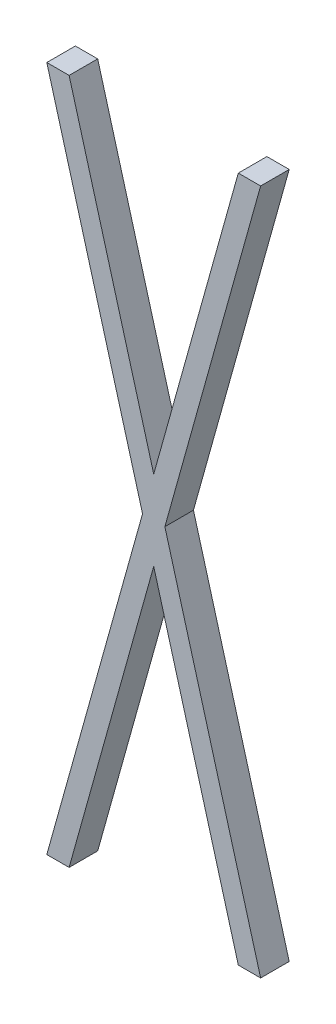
ISO-10303-21;
HEADER;
FILE_DESCRIPTION(('STEP AP214'),'2;1');
FILE_NAME('part.step','',(''),(''),'','','');
FILE_SCHEMA(('AUTOMOTIVE_DESIGN { 1 0 10303 214 1 1 1 1 }'));
ENDSEC;
DATA;
#1=APPLICATION_CONTEXT('core data for automotive mechanical design processes');
#2=APPLICATION_PROTOCOL_DEFINITION('international standard','automotive_design',2000,#1);
#3=PRODUCT_CONTEXT('',#1,'mechanical');
#4=PRODUCT('Part','Part','',(#3));
#5=PRODUCT_RELATED_PRODUCT_CATEGORY('part','',(#4));
#6=PRODUCT_DEFINITION_FORMATION('','',#4);
#7=PRODUCT_DEFINITION_CONTEXT('part definition',#1,'design');
#8=PRODUCT_DEFINITION('design','',#6,#7);
#9=PRODUCT_DEFINITION_SHAPE('','',#8);
#10=(LENGTH_UNIT() NAMED_UNIT(*) SI_UNIT(.MILLI.,.METRE.));
#11=(NAMED_UNIT(*) PLANE_ANGLE_UNIT() SI_UNIT($,.RADIAN.));
#12=(NAMED_UNIT(*) SI_UNIT($,.STERADIAN.) SOLID_ANGLE_UNIT());
#13=UNCERTAINTY_MEASURE_WITH_UNIT(LENGTH_MEASURE(1.E-05),#10,'distance_accuracy_value','');
#14=(GEOMETRIC_REPRESENTATION_CONTEXT(3) GLOBAL_UNCERTAINTY_ASSIGNED_CONTEXT((#13)) GLOBAL_UNIT_ASSIGNED_CONTEXT((#10,
#11,#12)) REPRESENTATION_CONTEXT('',''));
#15=CARTESIAN_POINT('',(0.,0.,0.));
#16=DIRECTION('',(0.,0.,1.));
#17=DIRECTION('',(1.,0.,0.));
#18=AXIS2_PLACEMENT_3D('',#15,#16,#17);
#19=CARTESIAN_POINT('',(12.1785029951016,30.0401103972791,3.175));
#20=DIRECTION('',(0.96316440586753,-0.268913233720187,0.));
#21=DIRECTION('',(0.268913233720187,0.96316440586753,0.));
#22=AXIS2_PLACEMENT_3D('',#19,#20,#21);
#23=PLANE('',#22);
#24=DIRECTION('',(-0.268913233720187,-0.96316440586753,0.));
#25=VECTOR('',#24,1.);
#26=CARTESIAN_POINT('',(12.1785029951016,30.0401103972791,0.));
#27=LINE('',#26,#25);
#28=CARTESIAN_POINT('',(12.1785029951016,30.0401103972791,0.));
#29=VERTEX_POINT('',#28);
#30=CARTESIAN_POINT('',(2.78050299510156,-3.62063199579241,0.));
#31=VERTEX_POINT('',#30);
#32=EDGE_CURVE('E150',#29,#31,#27,.T.);
#33=ORIENTED_EDGE('',*,*,#32,.T.);
#34=DIRECTION('',(0.,0.,-1.));
#35=VECTOR('',#34,1.);
#36=CARTESIAN_POINT('',(2.78050299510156,-3.62063199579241,3.175));
#37=LINE('',#36,#35);
#38=CARTESIAN_POINT('',(2.78050299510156,-3.62063199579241,3.175));
#39=VERTEX_POINT('',#38);
#40=EDGE_CURVE('E11',#39,#31,#37,.T.);
#41=ORIENTED_EDGE('',*,*,#40,.F.);
#42=DIRECTION('',(-0.268913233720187,-0.96316440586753,0.));
#43=VECTOR('',#42,1.);
#44=CARTESIAN_POINT('',(12.1785029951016,30.0401103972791,3.175));
#45=LINE('',#44,#43);
#46=CARTESIAN_POINT('',(12.1785029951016,30.0401103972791,3.175));
#47=VERTEX_POINT('',#46);
#48=EDGE_CURVE('E172',#47,#39,#45,.T.);
#49=ORIENTED_EDGE('',*,*,#48,.F.);
#50=DIRECTION('',(0.,0.,-1.));
#51=VECTOR('',#50,1.);
#52=CARTESIAN_POINT('',(12.1785029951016,30.0401103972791,3.175));
#53=LINE('',#52,#51);
#54=EDGE_CURVE('E146',#47,#29,#53,.T.);
#55=ORIENTED_EDGE('',*,*,#54,.T.);
#56=EDGE_LOOP('',(#33,#41,#49,#55));
#57=FACE_BOUND('',#56,.T.);
#58=ADVANCED_FACE('F30',(#57),#23,.F.);
#59=CARTESIAN_POINT('',(-6.61749700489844,30.0401103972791,3.175));
#60=DIRECTION('',(-0.96316440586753,-0.268913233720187,0.));
#61=DIRECTION('',(0.268913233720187,-0.96316440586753,0.));
#62=AXIS2_PLACEMENT_3D('',#59,#60,#61);
#63=PLANE('',#62);
#64=DIRECTION('',(-0.268913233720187,0.96316440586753,0.));
#65=VECTOR('',#64,1.);
#66=CARTESIAN_POINT('',(-6.61749700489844,30.0401103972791,0.));
#67=LINE('',#66,#65);
#68=CARTESIAN_POINT('',(-6.61749700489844,30.0401103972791,0.));
#69=VERTEX_POINT('',#68);
#70=EDGE_CURVE('E153',#31,#69,#67,.T.);
#71=ORIENTED_EDGE('',*,*,#70,.T.);
#72=DIRECTION('',(0.,0.,-1.));
#73=VECTOR('',#72,1.);
#74=CARTESIAN_POINT('',(-6.61749700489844,30.0401103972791,3.175));
#75=LINE('',#74,#73);
#76=CARTESIAN_POINT('',(-6.61749700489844,30.0401103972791,3.175));
#77=VERTEX_POINT('',#76);
#78=EDGE_CURVE('E38',#77,#69,#75,.T.);
#79=ORIENTED_EDGE('',*,*,#78,.F.);
#80=DIRECTION('',(-0.268913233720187,0.96316440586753,0.));
#81=VECTOR('',#80,1.);
#82=CARTESIAN_POINT('',(-6.61749700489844,30.0401103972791,3.175));
#83=LINE('',#82,#81);
#84=EDGE_CURVE('E101',#39,#77,#83,.T.);
#85=ORIENTED_EDGE('',*,*,#84,.F.);
#86=ORIENTED_EDGE('',*,*,#40,.T.);
#87=EDGE_LOOP('',(#71,#79,#85,#86));
#88=FACE_BOUND('',#87,.T.);
#89=ADVANCED_FACE('F250',(#88),#63,.F.);
#90=CARTESIAN_POINT('',(-9.09635754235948,30.0401103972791,3.175));
#91=DIRECTION('',(0.,-1.,0.));
#92=DIRECTION('',(0.,0.,-1.));
#93=AXIS2_PLACEMENT_3D('',#90,#91,#92);
#94=PLANE('',#93);
#95=DIRECTION('',(-1.,0.,0.));
#96=VECTOR('',#95,1.);
#97=CARTESIAN_POINT('',(-9.09635754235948,30.0401103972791,0.));
#98=LINE('',#97,#96);
#99=CARTESIAN_POINT('',(-9.09635754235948,30.0401103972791,0.));
#100=VERTEX_POINT('',#99);
#101=EDGE_CURVE('E155',#69,#100,#98,.T.);
#102=ORIENTED_EDGE('',*,*,#101,.T.);
#103=DIRECTION('',(0.,0.,-1.));
#104=VECTOR('',#103,1.);
#105=CARTESIAN_POINT('',(-9.09635754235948,30.0401103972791,3.175));
#106=LINE('',#105,#104);
#107=CARTESIAN_POINT('',(-9.09635754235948,30.0401103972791,3.175));
#108=VERTEX_POINT('',#107);
#109=EDGE_CURVE('E191',#108,#100,#106,.T.);
#110=ORIENTED_EDGE('',*,*,#109,.F.);
#111=DIRECTION('',(-1.,0.,0.));
#112=VECTOR('',#111,1.);
#113=CARTESIAN_POINT('',(-9.09635754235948,30.0401103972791,3.175));
#114=LINE('',#113,#112);
#115=EDGE_CURVE('E199',#77,#108,#114,.T.);
#116=ORIENTED_EDGE('',*,*,#115,.F.);
#117=ORIENTED_EDGE('',*,*,#78,.T.);
#118=EDGE_LOOP('',(#102,#110,#116,#117));
#119=FACE_BOUND('',#118,.T.);
#120=ADVANCED_FACE('F197',(#119),#94,.F.);
#121=CARTESIAN_POINT('',(1.54107272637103,-8.05988960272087,3.175));
#122=DIRECTION('',(0.96316440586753,0.268913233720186,0.));
#123=DIRECTION('',(-0.268913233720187,0.96316440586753,0.));
#124=AXIS2_PLACEMENT_3D('',#121,#122,#123);
#125=PLANE('',#124);
#126=DIRECTION('',(0.268913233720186,-0.96316440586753,0.));
#127=VECTOR('',#126,1.);
#128=CARTESIAN_POINT('',(1.54107272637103,-8.05988960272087,0.));
#129=LINE('',#128,#127);
#130=CARTESIAN_POINT('',(1.54107272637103,-8.05988960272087,0.));
#131=VERTEX_POINT('',#130);
#132=EDGE_CURVE('E157',#100,#131,#129,.T.);
#133=ORIENTED_EDGE('',*,*,#132,.T.);
#134=DIRECTION('',(0.,0.,-1.));
#135=VECTOR('',#134,1.);
#136=CARTESIAN_POINT('',(1.54107272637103,-8.05988960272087,3.175));
#137=LINE('',#136,#135);
#138=CARTESIAN_POINT('',(1.54107272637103,-8.05988960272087,3.175));
#139=VERTEX_POINT('',#138);
#140=EDGE_CURVE('E188',#139,#131,#137,.T.);
#141=ORIENTED_EDGE('',*,*,#140,.F.);
#142=DIRECTION('',(0.268913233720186,-0.96316440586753,0.));
#143=VECTOR('',#142,1.);
#144=CARTESIAN_POINT('',(1.54107272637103,-8.05988960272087,3.175));
#145=LINE('',#144,#143);
#146=EDGE_CURVE('E217',#108,#139,#145,.T.);
#147=ORIENTED_EDGE('',*,*,#146,.F.);
#148=ORIENTED_EDGE('',*,*,#109,.T.);
#149=EDGE_LOOP('',(#133,#141,#147,#148));
#150=FACE_BOUND('',#149,.T.);
#151=ADVANCED_FACE('F208',(#150),#125,.F.);
#152=CARTESIAN_POINT('',(1.54107272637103,-8.05988960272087,3.175));
#153=DIRECTION('',(0.96316440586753,-0.268913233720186,0.));
#154=DIRECTION('',(0.268913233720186,0.96316440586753,0.));
#155=AXIS2_PLACEMENT_3D('',#152,#153,#154);
#156=PLANE('',#155);
#157=DIRECTION('',(-0.268913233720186,-0.96316440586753,0.));
#158=VECTOR('',#157,1.);
#159=CARTESIAN_POINT('',(1.54107272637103,-8.05988960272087,0.));
#160=LINE('',#159,#158);
#161=CARTESIAN_POINT('',(-9.09635754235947,-46.1598896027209,0.));
#162=VERTEX_POINT('',#161);
#163=EDGE_CURVE('E159',#131,#162,#160,.T.);
#164=ORIENTED_EDGE('',*,*,#163,.T.);
#165=DIRECTION('',(0.,0.,-1.));
#166=VECTOR('',#165,1.);
#167=CARTESIAN_POINT('',(-9.09635754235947,-46.1598896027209,3.175));
#168=LINE('',#167,#166);
#169=CARTESIAN_POINT('',(-9.09635754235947,-46.1598896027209,3.175));
#170=VERTEX_POINT('',#169);
#171=EDGE_CURVE('E185',#170,#162,#168,.T.);
#172=ORIENTED_EDGE('',*,*,#171,.F.);
#173=DIRECTION('',(-0.268913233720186,-0.96316440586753,0.));
#174=VECTOR('',#173,1.);
#175=CARTESIAN_POINT('',(1.54107272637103,-8.05988960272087,3.175));
#176=LINE('',#175,#174);
#177=EDGE_CURVE('E214',#139,#170,#176,.T.);
#178=ORIENTED_EDGE('',*,*,#177,.F.);
#179=ORIENTED_EDGE('',*,*,#140,.T.);
#180=EDGE_LOOP('',(#164,#172,#178,#179));
#181=FACE_BOUND('',#180,.T.);
#182=ADVANCED_FACE('F212',(#181),#156,.F.);
#183=CARTESIAN_POINT('',(-9.09635754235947,-46.1598896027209,3.175));
#184=DIRECTION('',(0.,1.,0.));
#185=DIRECTION('',(0.,0.,1.));
#186=AXIS2_PLACEMENT_3D('',#183,#184,#185);
#187=PLANE('',#186);
#188=DIRECTION('',(1.,0.,0.));
#189=VECTOR('',#188,1.);
#190=CARTESIAN_POINT('',(-9.09635754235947,-46.1598896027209,0.));
#191=LINE('',#190,#189);
#192=CARTESIAN_POINT('',(-6.61749700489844,-46.1598896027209,0.));
#193=VERTEX_POINT('',#192);
#194=EDGE_CURVE('E161',#162,#193,#191,.T.);
#195=ORIENTED_EDGE('',*,*,#194,.T.);
#196=DIRECTION('',(0.,0.,-1.));
#197=VECTOR('',#196,1.);
#198=CARTESIAN_POINT('',(-6.61749700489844,-46.1598896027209,3.175));
#199=LINE('',#198,#197);
#200=CARTESIAN_POINT('',(-6.61749700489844,-46.1598896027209,3.175));
#201=VERTEX_POINT('',#200);
#202=EDGE_CURVE('E182',#201,#193,#199,.T.);
#203=ORIENTED_EDGE('',*,*,#202,.F.);
#204=DIRECTION('',(1.,0.,0.));
#205=VECTOR('',#204,1.);
#206=CARTESIAN_POINT('',(-9.09635754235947,-46.1598896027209,3.175));
#207=LINE('',#206,#205);
#208=EDGE_CURVE('E216',#170,#201,#207,.T.);
#209=ORIENTED_EDGE('',*,*,#208,.F.);
#210=ORIENTED_EDGE('',*,*,#171,.T.);
#211=EDGE_LOOP('',(#195,#203,#209,#210));
#212=FACE_BOUND('',#211,.T.);
#213=ADVANCED_FACE('F263',(#212),#187,.F.);
#214=CARTESIAN_POINT('',(-6.61749700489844,-46.1598896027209,3.175));
#215=DIRECTION('',(-0.96316440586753,0.268913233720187,0.));
#216=DIRECTION('',(-0.268913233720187,-0.96316440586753,0.));
#217=AXIS2_PLACEMENT_3D('',#214,#215,#216);
#218=PLANE('',#217);
#219=DIRECTION('',(0.268913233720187,0.96316440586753,0.));
#220=VECTOR('',#219,1.);
#221=CARTESIAN_POINT('',(-6.61749700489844,-46.1598896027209,0.));
#222=LINE('',#221,#220);
#223=CARTESIAN_POINT('',(2.78050299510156,-12.4991472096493,0.));
#224=VERTEX_POINT('',#223);
#225=EDGE_CURVE('E163',#193,#224,#222,.T.);
#226=ORIENTED_EDGE('',*,*,#225,.T.);
#227=DIRECTION('',(0.,0.,-1.));
#228=VECTOR('',#227,1.);
#229=CARTESIAN_POINT('',(2.78050299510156,-12.4991472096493,3.175));
#230=LINE('',#229,#228);
#231=CARTESIAN_POINT('',(2.78050299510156,-12.4991472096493,3.175));
#232=VERTEX_POINT('',#231);
#233=EDGE_CURVE('E179',#232,#224,#230,.T.);
#234=ORIENTED_EDGE('',*,*,#233,.F.);
#235=DIRECTION('',(0.268913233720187,0.96316440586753,0.));
#236=VECTOR('',#235,1.);
#237=CARTESIAN_POINT('',(-6.61749700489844,-46.1598896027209,3.175));
#238=LINE('',#237,#236);
#239=EDGE_CURVE('E219',#201,#232,#238,.T.);
#240=ORIENTED_EDGE('',*,*,#239,.F.);
#241=ORIENTED_EDGE('',*,*,#202,.T.);
#242=EDGE_LOOP('',(#226,#234,#240,#241));
#243=FACE_BOUND('',#242,.T.);
#244=ADVANCED_FACE('F266',(#243),#218,.F.);
#245=CARTESIAN_POINT('',(12.1785029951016,-46.1598896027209,3.175));
#246=DIRECTION('',(0.96316440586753,0.268913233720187,0.));
#247=DIRECTION('',(-0.268913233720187,0.96316440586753,0.));
#248=AXIS2_PLACEMENT_3D('',#245,#246,#247);
#249=PLANE('',#248);
#250=DIRECTION('',(0.268913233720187,-0.96316440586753,0.));
#251=VECTOR('',#250,1.);
#252=CARTESIAN_POINT('',(12.1785029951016,-46.1598896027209,0.));
#253=LINE('',#252,#251);
#254=CARTESIAN_POINT('',(12.1785029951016,-46.1598896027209,0.));
#255=VERTEX_POINT('',#254);
#256=EDGE_CURVE('E165',#224,#255,#253,.T.);
#257=ORIENTED_EDGE('',*,*,#256,.T.);
#258=DIRECTION('',(0.,0.,-1.));
#259=VECTOR('',#258,1.);
#260=CARTESIAN_POINT('',(12.1785029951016,-46.1598896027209,3.175));
#261=LINE('',#260,#259);
#262=CARTESIAN_POINT('',(12.1785029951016,-46.1598896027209,3.175));
#263=VERTEX_POINT('',#262);
#264=EDGE_CURVE('E176',#263,#255,#261,.T.);
#265=ORIENTED_EDGE('',*,*,#264,.F.);
#266=DIRECTION('',(0.268913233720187,-0.96316440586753,0.));
#267=VECTOR('',#266,1.);
#268=CARTESIAN_POINT('',(12.1785029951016,-46.1598896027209,3.175));
#269=LINE('',#268,#267);
#270=EDGE_CURVE('E225',#232,#263,#269,.T.);
#271=ORIENTED_EDGE('',*,*,#270,.F.);
#272=ORIENTED_EDGE('',*,*,#233,.T.);
#273=EDGE_LOOP('',(#257,#265,#271,#272));
#274=FACE_BOUND('',#273,.T.);
#275=ADVANCED_FACE('F231',(#274),#249,.F.);
#276=CARTESIAN_POINT('',(14.6573635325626,-46.1598896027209,3.175));
#277=DIRECTION('',(0.,1.,0.));
#278=DIRECTION('',(0.,0.,1.));
#279=AXIS2_PLACEMENT_3D('',#276,#277,#278);
#280=PLANE('',#279);
#281=DIRECTION('',(1.,0.,0.));
#282=VECTOR('',#281,1.);
#283=CARTESIAN_POINT('',(14.6573635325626,-46.1598896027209,0.));
#284=LINE('',#283,#282);
#285=CARTESIAN_POINT('',(14.6573635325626,-46.1598896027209,0.));
#286=VERTEX_POINT('',#285);
#287=EDGE_CURVE('E167',#255,#286,#284,.T.);
#288=ORIENTED_EDGE('',*,*,#287,.T.);
#289=DIRECTION('',(0.,0.,-1.));
#290=VECTOR('',#289,1.);
#291=CARTESIAN_POINT('',(14.6573635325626,-46.1598896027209,3.175));
#292=LINE('',#291,#290);
#293=CARTESIAN_POINT('',(14.6573635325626,-46.1598896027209,3.175));
#294=VERTEX_POINT('',#293);
#295=EDGE_CURVE('E141',#294,#286,#292,.T.);
#296=ORIENTED_EDGE('',*,*,#295,.F.);
#297=DIRECTION('',(1.,0.,0.));
#298=VECTOR('',#297,1.);
#299=CARTESIAN_POINT('',(14.6573635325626,-46.1598896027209,3.175));
#300=LINE('',#299,#298);
#301=EDGE_CURVE('E132',#263,#294,#300,.T.);
#302=ORIENTED_EDGE('',*,*,#301,.F.);
#303=ORIENTED_EDGE('',*,*,#264,.T.);
#304=EDGE_LOOP('',(#288,#296,#302,#303));
#305=FACE_BOUND('',#304,.T.);
#306=ADVANCED_FACE('F235',(#305),#280,.F.);
#307=CARTESIAN_POINT('',(4.01993326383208,-8.05988960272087,3.175));
#308=DIRECTION('',(-0.96316440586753,-0.268913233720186,0.));
#309=DIRECTION('',(0.268913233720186,-0.96316440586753,0.));
#310=AXIS2_PLACEMENT_3D('',#307,#308,#309);
#311=PLANE('',#310);
#312=DIRECTION('',(-0.268913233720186,0.96316440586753,0.));
#313=VECTOR('',#312,1.);
#314=CARTESIAN_POINT('',(4.01993326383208,-8.05988960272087,0.));
#315=LINE('',#314,#313);
#316=CARTESIAN_POINT('',(4.01993326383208,-8.05988960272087,0.));
#317=VERTEX_POINT('',#316);
#318=EDGE_CURVE('E140',#286,#317,#315,.T.);
#319=ORIENTED_EDGE('',*,*,#318,.T.);
#320=DIRECTION('',(0.,0.,-1.));
#321=VECTOR('',#320,1.);
#322=CARTESIAN_POINT('',(4.01993326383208,-8.05988960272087,3.175));
#323=LINE('',#322,#321);
#324=CARTESIAN_POINT('',(4.01993326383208,-8.05988960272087,3.175));
#325=VERTEX_POINT('',#324);
#326=EDGE_CURVE('E137',#325,#317,#323,.T.);
#327=ORIENTED_EDGE('',*,*,#326,.F.);
#328=DIRECTION('',(-0.268913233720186,0.96316440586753,0.));
#329=VECTOR('',#328,1.);
#330=CARTESIAN_POINT('',(4.01993326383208,-8.05988960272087,3.175));
#331=LINE('',#330,#329);
#332=EDGE_CURVE('E126',#294,#325,#331,.T.);
#333=ORIENTED_EDGE('',*,*,#332,.F.);
#334=ORIENTED_EDGE('',*,*,#295,.T.);
#335=EDGE_LOOP('',(#319,#327,#333,#334));
#336=FACE_BOUND('',#335,.T.);
#337=ADVANCED_FACE('F138',(#336),#311,.F.);
#338=CARTESIAN_POINT('',(4.01993326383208,-8.05988960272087,3.175));
#339=DIRECTION('',(-0.96316440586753,0.268913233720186,0.));
#340=DIRECTION('',(-0.268913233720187,-0.96316440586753,0.));
#341=AXIS2_PLACEMENT_3D('',#338,#339,#340);
#342=PLANE('',#341);
#343=DIRECTION('',(0.268913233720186,0.96316440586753,0.));
#344=VECTOR('',#343,1.);
#345=CARTESIAN_POINT('',(4.01993326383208,-8.05988960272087,0.));
#346=LINE('',#345,#344);
#347=CARTESIAN_POINT('',(14.6573635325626,30.0401103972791,0.));
#348=VERTEX_POINT('',#347);
#349=EDGE_CURVE('E87',#317,#348,#346,.T.);
#350=ORIENTED_EDGE('',*,*,#349,.T.);
#351=DIRECTION('',(0.,0.,-1.));
#352=VECTOR('',#351,1.);
#353=CARTESIAN_POINT('',(14.6573635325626,30.0401103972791,3.175));
#354=LINE('',#353,#352);
#355=CARTESIAN_POINT('',(14.6573635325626,30.0401103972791,3.175));
#356=VERTEX_POINT('',#355);
#357=EDGE_CURVE('E142',#356,#348,#354,.T.);
#358=ORIENTED_EDGE('',*,*,#357,.F.);
#359=DIRECTION('',(0.268913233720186,0.96316440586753,0.));
#360=VECTOR('',#359,1.);
#361=CARTESIAN_POINT('',(4.01993326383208,-8.05988960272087,3.175));
#362=LINE('',#361,#360);
#363=EDGE_CURVE('E130',#325,#356,#362,.T.);
#364=ORIENTED_EDGE('',*,*,#363,.F.);
#365=ORIENTED_EDGE('',*,*,#326,.T.);
#366=EDGE_LOOP('',(#350,#358,#364,#365));
#367=FACE_BOUND('',#366,.T.);
#368=ADVANCED_FACE('F144',(#367),#342,.F.);
#369=CARTESIAN_POINT('',(14.6573635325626,30.0401103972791,3.175));
#370=DIRECTION('',(0.,-1.,0.));
#371=DIRECTION('',(0.,0.,-1.));
#372=AXIS2_PLACEMENT_3D('',#369,#370,#371);
#373=PLANE('',#372);
#374=DIRECTION('',(-1.,0.,0.));
#375=VECTOR('',#374,1.);
#376=CARTESIAN_POINT('',(14.6573635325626,30.0401103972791,0.));
#377=LINE('',#376,#375);
#378=EDGE_CURVE('E93',#348,#29,#377,.T.);
#379=ORIENTED_EDGE('',*,*,#378,.T.);
#380=ORIENTED_EDGE('',*,*,#54,.F.);
#381=DIRECTION('',(-1.,0.,0.));
#382=VECTOR('',#381,1.);
#383=CARTESIAN_POINT('',(14.6573635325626,30.0401103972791,3.175));
#384=LINE('',#383,#382);
#385=EDGE_CURVE('E46',#356,#47,#384,.T.);
#386=ORIENTED_EDGE('',*,*,#385,.F.);
#387=ORIENTED_EDGE('',*,*,#357,.T.);
#388=EDGE_LOOP('',(#379,#380,#386,#387));
#389=FACE_BOUND('',#388,.T.);
#390=ADVANCED_FACE('F239',(#389),#373,.F.);
#391=CARTESIAN_POINT('',(12.1785029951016,30.0401103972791,3.175));
#392=DIRECTION('',(0.,0.,1.));
#393=DIRECTION('',(1.,0.,0.));
#394=AXIS2_PLACEMENT_3D('',#391,#392,#393);
#395=PLANE('',#394);
#396=ORIENTED_EDGE('',*,*,#48,.T.);
#397=ORIENTED_EDGE('',*,*,#84,.T.);
#398=ORIENTED_EDGE('',*,*,#115,.T.);
#399=ORIENTED_EDGE('',*,*,#146,.T.);
#400=ORIENTED_EDGE('',*,*,#177,.T.);
#401=ORIENTED_EDGE('',*,*,#208,.T.);
#402=ORIENTED_EDGE('',*,*,#239,.T.);
#403=ORIENTED_EDGE('',*,*,#270,.T.);
#404=ORIENTED_EDGE('',*,*,#301,.T.);
#405=ORIENTED_EDGE('',*,*,#332,.T.);
#406=ORIENTED_EDGE('',*,*,#363,.T.);
#407=ORIENTED_EDGE('',*,*,#385,.T.);
#408=EDGE_LOOP('',(#396,#397,#398,#399,#400,#401,#402,#403,#404,#405,#406,#407));
#409=FACE_BOUND('',#408,.T.);
#410=ADVANCED_FACE('F128',(#409),#395,.T.);
#411=CARTESIAN_POINT('',(12.1785029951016,30.0401103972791,0.));
#412=DIRECTION('',(0.,0.,1.));
#413=DIRECTION('',(1.,0.,0.));
#414=AXIS2_PLACEMENT_3D('',#411,#412,#413);
#415=PLANE('',#414);
#416=ORIENTED_EDGE('',*,*,#32,.F.);
#417=ORIENTED_EDGE('',*,*,#378,.F.);
#418=ORIENTED_EDGE('',*,*,#349,.F.);
#419=ORIENTED_EDGE('',*,*,#318,.F.);
#420=ORIENTED_EDGE('',*,*,#287,.F.);
#421=ORIENTED_EDGE('',*,*,#256,.F.);
#422=ORIENTED_EDGE('',*,*,#225,.F.);
#423=ORIENTED_EDGE('',*,*,#194,.F.);
#424=ORIENTED_EDGE('',*,*,#163,.F.);
#425=ORIENTED_EDGE('',*,*,#132,.F.);
#426=ORIENTED_EDGE('',*,*,#101,.F.);
#427=ORIENTED_EDGE('',*,*,#70,.F.);
#428=EDGE_LOOP('',(#416,#417,#418,#419,#420,#421,#422,#423,#424,#425,#426,#427));
#429=FACE_BOUND('',#428,.T.);
#430=ADVANCED_FACE('F203',(#429),#415,.F.);
#431=CLOSED_SHELL('',(#58,#89,#120,#151,#182,#213,#244,#275,#306,#337,#368,#390,#410,#430));
#432=MANIFOLD_SOLID_BREP('B2',#431);
#433=ADVANCED_BREP_SHAPE_REPRESENTATION('',(#18,#432),#14);
#434=SHAPE_DEFINITION_REPRESENTATION(#9,#433);
ENDSEC;
END-ISO-10303-21;
